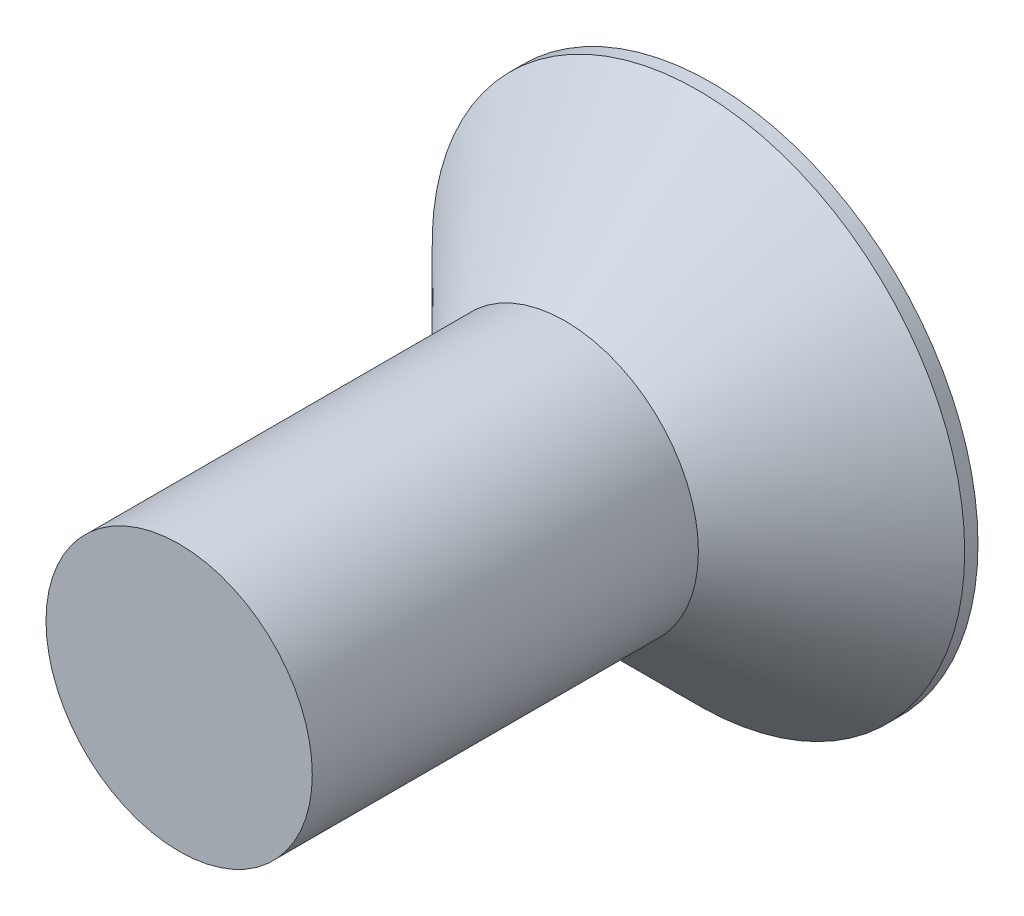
ISO-10303-21;
HEADER;
FILE_DESCRIPTION(('STEP AP214'),'2;1');
FILE_NAME('part.step','',(''),(''),'','','');
FILE_SCHEMA(('AUTOMOTIVE_DESIGN { 1 0 10303 214 1 1 1 1 }'));
ENDSEC;
DATA;
#1=APPLICATION_CONTEXT('core data for automotive mechanical design processes');
#2=APPLICATION_PROTOCOL_DEFINITION('international standard','automotive_design',2000,#1);
#3=PRODUCT_CONTEXT('',#1,'mechanical');
#4=PRODUCT('Part','Part','',(#3));
#5=PRODUCT_RELATED_PRODUCT_CATEGORY('part','',(#4));
#6=PRODUCT_DEFINITION_FORMATION('','',#4);
#7=PRODUCT_DEFINITION_CONTEXT('part definition',#1,'design');
#8=PRODUCT_DEFINITION('design','',#6,#7);
#9=PRODUCT_DEFINITION_SHAPE('','',#8);
#10=(LENGTH_UNIT() NAMED_UNIT(*) SI_UNIT(.MILLI.,.METRE.));
#11=(NAMED_UNIT(*) PLANE_ANGLE_UNIT() SI_UNIT($,.RADIAN.));
#12=(NAMED_UNIT(*) SI_UNIT($,.STERADIAN.) SOLID_ANGLE_UNIT());
#13=UNCERTAINTY_MEASURE_WITH_UNIT(LENGTH_MEASURE(1.E-05),#10,'distance_accuracy_value','');
#14=(GEOMETRIC_REPRESENTATION_CONTEXT(3) GLOBAL_UNCERTAINTY_ASSIGNED_CONTEXT((#13)) GLOBAL_UNIT_ASSIGNED_CONTEXT((#10,
#11,#12)) REPRESENTATION_CONTEXT('',''));
#15=CARTESIAN_POINT('',(0.,0.,0.));
#16=DIRECTION('',(0.,0.,1.));
#17=DIRECTION('',(1.,0.,0.));
#18=AXIS2_PLACEMENT_3D('',#15,#16,#17);
#19=CARTESIAN_POINT('',(0.,0.,16.));
#20=DIRECTION('',(0.,0.,1.));
#21=DIRECTION('',(1.,0.,0.));
#22=AXIS2_PLACEMENT_3D('',#19,#20,#21);
#23=PLANE('',#22);
#24=CARTESIAN_POINT('',(0.,0.,16.));
#25=DIRECTION('',(0.,0.,1.));
#26=DIRECTION('',(1.,0.,0.));
#27=AXIS2_PLACEMENT_3D('',#24,#25,#26);
#28=CIRCLE('',#27,4.);
#29=CARTESIAN_POINT('',(4.,0.,16.));
#30=VERTEX_POINT('',#29);
#31=EDGE_CURVE('E11',#30,#30,#28,.T.);
#32=ORIENTED_EDGE('',*,*,#31,.T.);
#33=EDGE_LOOP('',(#32));
#34=FACE_BOUND('',#33,.T.);
#35=ADVANCED_FACE('F32',(#34),#23,.T.);
#36=CARTESIAN_POINT('',(0.,0.,16.));
#37=DIRECTION('',(0.,0.,1.));
#38=DIRECTION('',(1.,0.,0.));
#39=AXIS2_PLACEMENT_3D('',#36,#37,#38);
#40=CYLINDRICAL_SURFACE('',#39,4.);
#41=CARTESIAN_POINT('',(0.,0.,4.4));
#42=DIRECTION('',(0.,0.,1.));
#43=DIRECTION('',(1.,0.,0.));
#44=AXIS2_PLACEMENT_3D('',#41,#42,#43);
#45=CIRCLE('',#44,4.);
#46=CARTESIAN_POINT('',(4.,0.,4.4));
#47=VERTEX_POINT('',#46);
#48=EDGE_CURVE('E39',#47,#47,#45,.T.);
#49=ORIENTED_EDGE('',*,*,#48,.T.);
#50=EDGE_LOOP('',(#49));
#51=FACE_BOUND('',#50,.T.);
#52=ORIENTED_EDGE('',*,*,#31,.F.);
#53=EDGE_LOOP('',(#52));
#54=FACE_BOUND('',#53,.T.);
#55=ADVANCED_FACE('F146',(#51,#54),#40,.T.);
#56=CARTESIAN_POINT('',(0.,0.,4.4));
#57=DIRECTION('',(0.,0.,-1.));
#58=DIRECTION('',(-1.,0.,0.));
#59=AXIS2_PLACEMENT_3D('',#56,#57,#58);
#60=CONICAL_SURFACE('',#59,4.,0.78539816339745);
#61=CARTESIAN_POINT('',(0.,0.,0.400000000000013));
#62=DIRECTION('',(0.,0.,1.));
#63=DIRECTION('',(1.,0.,0.));
#64=AXIS2_PLACEMENT_3D('',#61,#62,#63);
#65=CIRCLE('',#64,8.);
#66=CARTESIAN_POINT('',(8.,0.,0.400000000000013));
#67=VERTEX_POINT('',#66);
#68=EDGE_CURVE('E141',#67,#67,#65,.T.);
#69=ORIENTED_EDGE('',*,*,#68,.T.);
#70=EDGE_LOOP('',(#69));
#71=FACE_BOUND('',#70,.T.);
#72=ORIENTED_EDGE('',*,*,#48,.F.);
#73=EDGE_LOOP('',(#72));
#74=FACE_BOUND('',#73,.T.);
#75=ADVANCED_FACE('F149',(#71,#74),#60,.T.);
#76=CARTESIAN_POINT('',(0.,0.,16.));
#77=DIRECTION('',(0.,0.,1.));
#78=DIRECTION('',(1.,0.,0.));
#79=AXIS2_PLACEMENT_3D('',#76,#77,#78);
#80=CYLINDRICAL_SURFACE('',#79,8.);
#81=CARTESIAN_POINT('',(0.,0.,0.));
#82=DIRECTION('',(0.,0.,1.));
#83=DIRECTION('',(1.,0.,0.));
#84=AXIS2_PLACEMENT_3D('',#81,#82,#83);
#85=CIRCLE('',#84,8.);
#86=CARTESIAN_POINT('',(8.,0.,0.));
#87=VERTEX_POINT('',#86);
#88=EDGE_CURVE('E133',#87,#87,#85,.T.);
#89=ORIENTED_EDGE('',*,*,#88,.T.);
#90=EDGE_LOOP('',(#89));
#91=FACE_BOUND('',#90,.T.);
#92=ORIENTED_EDGE('',*,*,#68,.F.);
#93=EDGE_LOOP('',(#92));
#94=FACE_BOUND('',#93,.T.);
#95=ADVANCED_FACE('F151',(#91,#94),#80,.T.);
#96=CARTESIAN_POINT('',(0.,-8.,0.));
#97=DIRECTION('',(0.,0.,-1.));
#98=DIRECTION('',(-1.,0.,0.));
#99=AXIS2_PLACEMENT_3D('',#96,#97,#98);
#100=PLANE('',#99);
#101=DIRECTION('',(0.866025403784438,-0.5,0.));
#102=VECTOR('',#101,1.);
#103=CARTESIAN_POINT('',(0.,2.88675134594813,0.));
#104=LINE('',#103,#102);
#105=CARTESIAN_POINT('',(0.,2.88675134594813,0.));
#106=VERTEX_POINT('',#105);
#107=CARTESIAN_POINT('',(2.5,1.44337567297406,0.));
#108=VERTEX_POINT('',#107);
#109=EDGE_CURVE('E46',#106,#108,#104,.T.);
#110=ORIENTED_EDGE('',*,*,#109,.F.);
#111=DIRECTION('',(0.866025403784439,0.5,0.));
#112=VECTOR('',#111,1.);
#113=CARTESIAN_POINT('',(-2.5,1.44337567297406,0.));
#114=LINE('',#113,#112);
#115=CARTESIAN_POINT('',(-2.5,1.44337567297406,0.));
#116=VERTEX_POINT('',#115);
#117=EDGE_CURVE('E129',#116,#106,#114,.T.);
#118=ORIENTED_EDGE('',*,*,#117,.F.);
#119=DIRECTION('',(0.,1.,0.));
#120=VECTOR('',#119,1.);
#121=CARTESIAN_POINT('',(-2.5,-1.44337567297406,0.));
#122=LINE('',#121,#120);
#123=CARTESIAN_POINT('',(-2.5,-1.44337567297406,0.));
#124=VERTEX_POINT('',#123);
#125=EDGE_CURVE('E127',#124,#116,#122,.T.);
#126=ORIENTED_EDGE('',*,*,#125,.F.);
#127=DIRECTION('',(-0.866025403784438,0.5,0.));
#128=VECTOR('',#127,1.);
#129=CARTESIAN_POINT('',(0.,-2.88675134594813,0.));
#130=LINE('',#129,#128);
#131=CARTESIAN_POINT('',(0.,-2.88675134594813,0.));
#132=VERTEX_POINT('',#131);
#133=EDGE_CURVE('E94',#132,#124,#130,.T.);
#134=ORIENTED_EDGE('',*,*,#133,.F.);
#135=DIRECTION('',(-0.866025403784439,-0.5,0.));
#136=VECTOR('',#135,1.);
#137=CARTESIAN_POINT('',(2.5,-1.44337567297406,0.));
#138=LINE('',#137,#136);
#139=CARTESIAN_POINT('',(2.5,-1.44337567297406,0.));
#140=VERTEX_POINT('',#139);
#141=EDGE_CURVE('E123',#140,#132,#138,.T.);
#142=ORIENTED_EDGE('',*,*,#141,.F.);
#143=DIRECTION('',(0.,-1.,0.));
#144=VECTOR('',#143,1.);
#145=CARTESIAN_POINT('',(2.5,1.44337567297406,0.));
#146=LINE('',#145,#144);
#147=EDGE_CURVE('E120',#108,#140,#146,.T.);
#148=ORIENTED_EDGE('',*,*,#147,.F.);
#149=EDGE_LOOP('',(#110,#118,#126,#134,#142,#148));
#150=FACE_BOUND('',#149,.T.);
#151=ORIENTED_EDGE('',*,*,#88,.F.);
#152=EDGE_LOOP('',(#151));
#153=FACE_BOUND('',#152,.T.);
#154=ADVANCED_FACE('F158',(#150,#153),#100,.T.);
#155=CARTESIAN_POINT('',(0.,2.88675134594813,4.));
#156=DIRECTION('',(0.5,0.866025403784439,0.));
#157=DIRECTION('',(-0.866025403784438,0.5,0.));
#158=AXIS2_PLACEMENT_3D('',#155,#156,#157);
#159=PLANE('',#158);
#160=ORIENTED_EDGE('',*,*,#109,.T.);
#161=DIRECTION('',(0.,0.,-1.));
#162=VECTOR('',#161,1.);
#163=CARTESIAN_POINT('',(2.5,1.44337567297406,4.));
#164=LINE('',#163,#162);
#165=CARTESIAN_POINT('',(2.5,1.44337567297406,4.));
#166=VERTEX_POINT('',#165);
#167=EDGE_CURVE('E76',#166,#108,#164,.T.);
#168=ORIENTED_EDGE('',*,*,#167,.F.);
#169=DIRECTION('',(0.866025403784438,-0.5,0.));
#170=VECTOR('',#169,1.);
#171=CARTESIAN_POINT('',(0.,2.88675134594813,4.));
#172=LINE('',#171,#170);
#173=CARTESIAN_POINT('',(0.,2.88675134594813,4.));
#174=VERTEX_POINT('',#173);
#175=EDGE_CURVE('E131',#174,#166,#172,.T.);
#176=ORIENTED_EDGE('',*,*,#175,.F.);
#177=DIRECTION('',(0.,0.,-1.));
#178=VECTOR('',#177,1.);
#179=CARTESIAN_POINT('',(0.,2.88675134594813,4.));
#180=LINE('',#179,#178);
#181=EDGE_CURVE('E54',#174,#106,#180,.T.);
#182=ORIENTED_EDGE('',*,*,#181,.T.);
#183=EDGE_LOOP('',(#160,#168,#176,#182));
#184=FACE_BOUND('',#183,.T.);
#185=ADVANCED_FACE('F189',(#184),#159,.F.);
#186=CARTESIAN_POINT('',(-2.5,1.44337567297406,4.));
#187=DIRECTION('',(-0.5,0.866025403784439,0.));
#188=DIRECTION('',(-0.866025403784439,-0.5,0.));
#189=AXIS2_PLACEMENT_3D('',#186,#187,#188);
#190=PLANE('',#189);
#191=ORIENTED_EDGE('',*,*,#117,.T.);
#192=ORIENTED_EDGE('',*,*,#181,.F.);
#193=DIRECTION('',(0.866025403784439,0.5,0.));
#194=VECTOR('',#193,1.);
#195=CARTESIAN_POINT('',(-2.5,1.44337567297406,4.));
#196=LINE('',#195,#194);
#197=CARTESIAN_POINT('',(-2.5,1.44337567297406,4.));
#198=VERTEX_POINT('',#197);
#199=EDGE_CURVE('E106',#198,#174,#196,.T.);
#200=ORIENTED_EDGE('',*,*,#199,.F.);
#201=DIRECTION('',(0.,0.,-1.));
#202=VECTOR('',#201,1.);
#203=CARTESIAN_POINT('',(-2.5,1.44337567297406,4.));
#204=LINE('',#203,#202);
#205=EDGE_CURVE('E98',#198,#116,#204,.T.);
#206=ORIENTED_EDGE('',*,*,#205,.T.);
#207=EDGE_LOOP('',(#191,#192,#200,#206));
#208=FACE_BOUND('',#207,.T.);
#209=ADVANCED_FACE('F199',(#208),#190,.F.);
#210=CARTESIAN_POINT('',(-2.5,-1.44337567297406,4.));
#211=DIRECTION('',(-1.,0.,0.));
#212=DIRECTION('',(0.,0.,1.));
#213=AXIS2_PLACEMENT_3D('',#210,#211,#212);
#214=PLANE('',#213);
#215=ORIENTED_EDGE('',*,*,#125,.T.);
#216=ORIENTED_EDGE('',*,*,#205,.F.);
#217=DIRECTION('',(0.,1.,0.));
#218=VECTOR('',#217,1.);
#219=CARTESIAN_POINT('',(-2.5,-1.44337567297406,4.));
#220=LINE('',#219,#218);
#221=CARTESIAN_POINT('',(-2.5,-1.44337567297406,4.));
#222=VERTEX_POINT('',#221);
#223=EDGE_CURVE('E102',#222,#198,#220,.T.);
#224=ORIENTED_EDGE('',*,*,#223,.F.);
#225=DIRECTION('',(0.,0.,-1.));
#226=VECTOR('',#225,1.);
#227=CARTESIAN_POINT('',(-2.5,-1.44337567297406,4.));
#228=LINE('',#227,#226);
#229=EDGE_CURVE('E87',#222,#124,#228,.T.);
#230=ORIENTED_EDGE('',*,*,#229,.T.);
#231=EDGE_LOOP('',(#215,#216,#224,#230));
#232=FACE_BOUND('',#231,.T.);
#233=ADVANCED_FACE('F103',(#232),#214,.F.);
#234=CARTESIAN_POINT('',(0.,-2.88675134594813,4.));
#235=DIRECTION('',(-0.5,-0.866025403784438,0.));
#236=DIRECTION('',(0.866025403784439,-0.5,0.));
#237=AXIS2_PLACEMENT_3D('',#234,#235,#236);
#238=PLANE('',#237);
#239=ORIENTED_EDGE('',*,*,#133,.T.);
#240=ORIENTED_EDGE('',*,*,#229,.F.);
#241=DIRECTION('',(-0.866025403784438,0.5,0.));
#242=VECTOR('',#241,1.);
#243=CARTESIAN_POINT('',(0.,-2.88675134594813,4.));
#244=LINE('',#243,#242);
#245=CARTESIAN_POINT('',(0.,-2.88675134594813,4.));
#246=VERTEX_POINT('',#245);
#247=EDGE_CURVE('E91',#246,#222,#244,.T.);
#248=ORIENTED_EDGE('',*,*,#247,.F.);
#249=DIRECTION('',(0.,0.,-1.));
#250=VECTOR('',#249,1.);
#251=CARTESIAN_POINT('',(0.,-2.88675134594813,4.));
#252=LINE('',#251,#250);
#253=EDGE_CURVE('E99',#246,#132,#252,.T.);
#254=ORIENTED_EDGE('',*,*,#253,.T.);
#255=EDGE_LOOP('',(#239,#240,#248,#254));
#256=FACE_BOUND('',#255,.T.);
#257=ADVANCED_FACE('F89',(#256),#238,.F.);
#258=CARTESIAN_POINT('',(2.5,-1.44337567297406,4.));
#259=DIRECTION('',(0.5,-0.866025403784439,0.));
#260=DIRECTION('',(0.866025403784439,0.5,0.));
#261=AXIS2_PLACEMENT_3D('',#258,#259,#260);
#262=PLANE('',#261);
#263=ORIENTED_EDGE('',*,*,#141,.T.);
#264=ORIENTED_EDGE('',*,*,#253,.F.);
#265=DIRECTION('',(-0.866025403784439,-0.5,0.));
#266=VECTOR('',#265,1.);
#267=CARTESIAN_POINT('',(2.5,-1.44337567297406,4.));
#268=LINE('',#267,#266);
#269=CARTESIAN_POINT('',(2.5,-1.44337567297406,4.));
#270=VERTEX_POINT('',#269);
#271=EDGE_CURVE('E112',#270,#246,#268,.T.);
#272=ORIENTED_EDGE('',*,*,#271,.F.);
#273=DIRECTION('',(0.,0.,-1.));
#274=VECTOR('',#273,1.);
#275=CARTESIAN_POINT('',(2.5,-1.44337567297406,4.));
#276=LINE('',#275,#274);
#277=EDGE_CURVE('E136',#270,#140,#276,.T.);
#278=ORIENTED_EDGE('',*,*,#277,.T.);
#279=EDGE_LOOP('',(#263,#264,#272,#278));
#280=FACE_BOUND('',#279,.T.);
#281=ADVANCED_FACE('F224',(#280),#262,.F.);
#282=CARTESIAN_POINT('',(2.5,1.44337567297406,4.));
#283=DIRECTION('',(1.,0.,0.));
#284=DIRECTION('',(0.,0.,-1.));
#285=AXIS2_PLACEMENT_3D('',#282,#283,#284);
#286=PLANE('',#285);
#287=ORIENTED_EDGE('',*,*,#147,.T.);
#288=ORIENTED_EDGE('',*,*,#277,.F.);
#289=DIRECTION('',(0.,-1.,0.));
#290=VECTOR('',#289,1.);
#291=CARTESIAN_POINT('',(2.5,1.44337567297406,4.));
#292=LINE('',#291,#290);
#293=EDGE_CURVE('E114',#166,#270,#292,.T.);
#294=ORIENTED_EDGE('',*,*,#293,.F.);
#295=ORIENTED_EDGE('',*,*,#167,.T.);
#296=EDGE_LOOP('',(#287,#288,#294,#295));
#297=FACE_BOUND('',#296,.T.);
#298=ADVANCED_FACE('F233',(#297),#286,.F.);
#299=CARTESIAN_POINT('',(0.,2.88675134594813,4.));
#300=DIRECTION('',(0.,0.,1.));
#301=DIRECTION('',(1.,0.,0.));
#302=AXIS2_PLACEMENT_3D('',#299,#300,#301);
#303=PLANE('',#302);
#304=ORIENTED_EDGE('',*,*,#175,.T.);
#305=ORIENTED_EDGE('',*,*,#293,.T.);
#306=ORIENTED_EDGE('',*,*,#271,.T.);
#307=ORIENTED_EDGE('',*,*,#247,.T.);
#308=ORIENTED_EDGE('',*,*,#223,.T.);
#309=ORIENTED_EDGE('',*,*,#199,.T.);
#310=EDGE_LOOP('',(#304,#305,#306,#307,#308,#309));
#311=FACE_BOUND('',#310,.T.);
#312=ADVANCED_FACE('F109',(#311),#303,.F.);
#313=CLOSED_SHELL('',(#35,#55,#75,#95,#154,#185,#209,#233,#257,#281,#298,#312));
#314=MANIFOLD_SOLID_BREP('B2',#313);
#315=ADVANCED_BREP_SHAPE_REPRESENTATION('',(#18,#314),#14);
#316=SHAPE_DEFINITION_REPRESENTATION(#9,#315);
ENDSEC;
END-ISO-10303-21;
